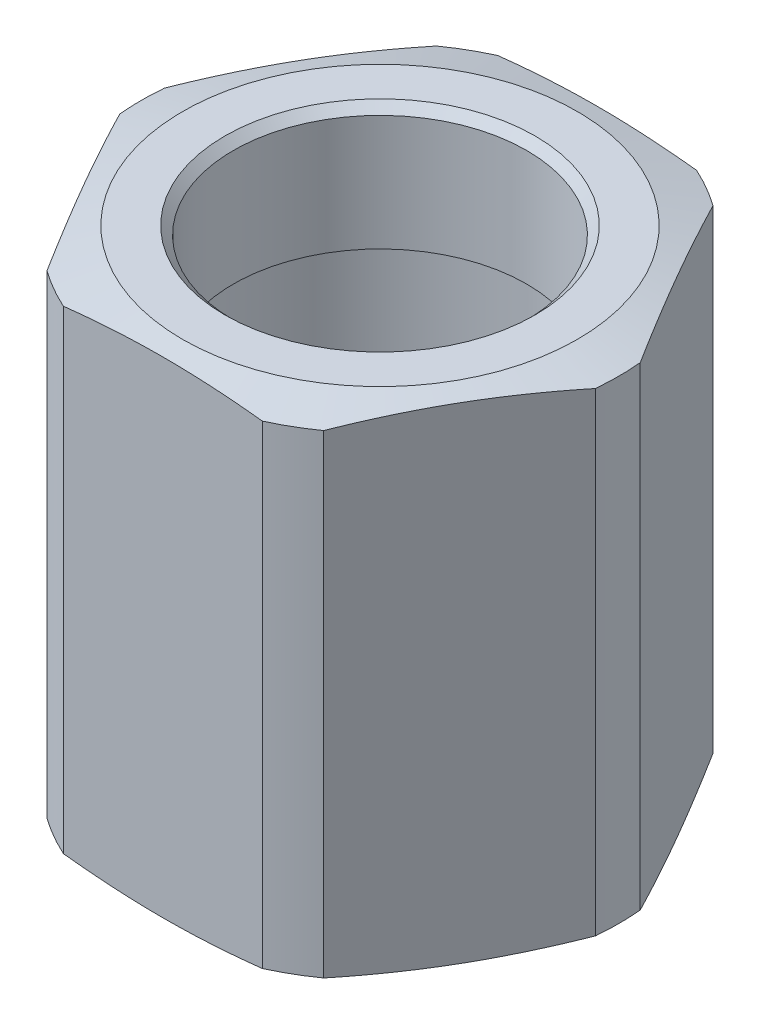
ISO-10303-21;
HEADER;
FILE_DESCRIPTION(('STEP AP214'),'2;1');
FILE_NAME('part.step','',(''),(''),'','','');
FILE_SCHEMA(('AUTOMOTIVE_DESIGN { 1 0 10303 214 1 1 1 1 }'));
ENDSEC;
DATA;
#1=APPLICATION_CONTEXT('core data for automotive mechanical design processes');
#2=APPLICATION_PROTOCOL_DEFINITION('international standard','automotive_design',2000,#1);
#3=PRODUCT_CONTEXT('',#1,'mechanical');
#4=PRODUCT('Part','Part','',(#3));
#5=PRODUCT_RELATED_PRODUCT_CATEGORY('part','',(#4));
#6=PRODUCT_DEFINITION_FORMATION('','',#4);
#7=PRODUCT_DEFINITION_CONTEXT('part definition',#1,'design');
#8=PRODUCT_DEFINITION('design','',#6,#7);
#9=PRODUCT_DEFINITION_SHAPE('','',#8);
#10=(LENGTH_UNIT() NAMED_UNIT(*) SI_UNIT(.MILLI.,.METRE.));
#11=(NAMED_UNIT(*) PLANE_ANGLE_UNIT() SI_UNIT($,.RADIAN.));
#12=(NAMED_UNIT(*) SI_UNIT($,.STERADIAN.) SOLID_ANGLE_UNIT());
#13=UNCERTAINTY_MEASURE_WITH_UNIT(LENGTH_MEASURE(1.E-05),#10,'distance_accuracy_value','');
#14=(GEOMETRIC_REPRESENTATION_CONTEXT(3) GLOBAL_UNCERTAINTY_ASSIGNED_CONTEXT((#13)) GLOBAL_UNIT_ASSIGNED_CONTEXT((#10,
#11,#12)) REPRESENTATION_CONTEXT('',''));
#15=CARTESIAN_POINT('',(0.,0.,0.));
#16=DIRECTION('',(0.,0.,1.));
#17=DIRECTION('',(1.,0.,0.));
#18=AXIS2_PLACEMENT_3D('',#15,#16,#17);
#19=CARTESIAN_POINT('',(0.,0.,0.));
#20=DIRECTION('',(0.,1.,0.));
#21=DIRECTION('',(0.,0.,1.));
#22=AXIS2_PLACEMENT_3D('',#19,#20,#21);
#23=CYLINDRICAL_SURFACE('',#22,4.7295);
#24=CARTESIAN_POINT('',(0.,12.,0.));
#25=DIRECTION('',(0.,1.,0.));
#26=DIRECTION('',(0.,0.,1.));
#27=AXIS2_PLACEMENT_3D('',#24,#25,#26);
#28=CIRCLE('',#27,4.7295);
#29=CARTESIAN_POINT('',(0.,12.,4.7295));
#30=VERTEX_POINT('',#29);
#31=EDGE_CURVE('E128',#30,#30,#28,.T.);
#32=ORIENTED_EDGE('',*,*,#31,.F.);
#33=EDGE_LOOP('',(#32));
#34=FACE_BOUND('',#33,.T.);
#35=CARTESIAN_POINT('',(0.,15.7295,0.));
#36=DIRECTION('',(0.,1.,0.));
#37=DIRECTION('',(0.,0.,1.));
#38=AXIS2_PLACEMENT_3D('',#35,#36,#37);
#39=CIRCLE('',#38,4.7295);
#40=CARTESIAN_POINT('',(0.,15.7295,4.7295));
#41=VERTEX_POINT('',#40);
#42=EDGE_CURVE('E221',#41,#41,#39,.T.);
#43=ORIENTED_EDGE('',*,*,#42,.T.);
#44=EDGE_LOOP('',(#43));
#45=FACE_BOUND('',#44,.T.);
#46=ADVANCED_FACE('F16',(#34,#45),#23,.F.);
#47=CARTESIAN_POINT('',(4.7295,12.,0.));
#48=DIRECTION('',(0.,1.,0.));
#49=DIRECTION('',(0.,0.,1.));
#50=AXIS2_PLACEMENT_3D('',#47,#48,#49);
#51=PLANE('',#50);
#52=CARTESIAN_POINT('',(0.,12.,0.));
#53=DIRECTION('',(0.,1.,0.));
#54=DIRECTION('',(0.,0.,1.));
#55=AXIS2_PLACEMENT_3D('',#52,#53,#54);
#56=CIRCLE('',#55,5.28301886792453);
#57=CARTESIAN_POINT('',(0.,12.,5.28301886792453));
#58=VERTEX_POINT('',#57);
#59=EDGE_CURVE('E133',#58,#58,#56,.T.);
#60=ORIENTED_EDGE('',*,*,#59,.F.);
#61=EDGE_LOOP('',(#60));
#62=FACE_BOUND('',#61,.T.);
#63=ORIENTED_EDGE('',*,*,#31,.T.);
#64=EDGE_LOOP('',(#63));
#65=FACE_BOUND('',#64,.T.);
#66=ADVANCED_FACE('F243',(#62,#65),#51,.F.);
#67=CARTESIAN_POINT('',(0.,0.,0.));
#68=DIRECTION('',(0.,1.,0.));
#69=DIRECTION('',(0.,0.,1.));
#70=AXIS2_PLACEMENT_3D('',#67,#68,#69);
#71=CYLINDRICAL_SURFACE('',#70,5.28301886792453);
#72=CARTESIAN_POINT('',(0.,0.25,0.));
#73=DIRECTION('',(0.,1.,0.));
#74=DIRECTION('',(0.,0.,1.));
#75=AXIS2_PLACEMENT_3D('',#72,#73,#74);
#76=CIRCLE('',#75,5.28301886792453);
#77=CARTESIAN_POINT('',(0.,0.25,5.28301886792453));
#78=VERTEX_POINT('',#77);
#79=EDGE_CURVE('E236',#78,#78,#76,.T.);
#80=ORIENTED_EDGE('',*,*,#79,.F.);
#81=EDGE_LOOP('',(#80));
#82=FACE_BOUND('',#81,.T.);
#83=ORIENTED_EDGE('',*,*,#59,.T.);
#84=EDGE_LOOP('',(#83));
#85=FACE_BOUND('',#84,.T.);
#86=ADVANCED_FACE('F241',(#82,#85),#71,.F.);
#87=CARTESIAN_POINT('',(0.,0.25,0.));
#88=DIRECTION('',(0.,-1.,0.));
#89=DIRECTION('',(0.,0.,-1.));
#90=AXIS2_PLACEMENT_3D('',#87,#88,#89);
#91=CONICAL_SURFACE('',#90,5.28301886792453,0.785398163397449);
#92=CARTESIAN_POINT('',(0.,0.,0.));
#93=DIRECTION('',(0.,1.,0.));
#94=DIRECTION('',(0.,0.,1.));
#95=AXIS2_PLACEMENT_3D('',#92,#93,#94);
#96=CIRCLE('',#95,5.53301886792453);
#97=CARTESIAN_POINT('',(0.,0.,5.53301886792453));
#98=VERTEX_POINT('',#97);
#99=EDGE_CURVE('E233',#98,#98,#96,.T.);
#100=ORIENTED_EDGE('',*,*,#99,.F.);
#101=EDGE_LOOP('',(#100));
#102=FACE_BOUND('',#101,.T.);
#103=ORIENTED_EDGE('',*,*,#79,.T.);
#104=EDGE_LOOP('',(#103));
#105=FACE_BOUND('',#104,.T.);
#106=ADVANCED_FACE('F381',(#102,#105),#91,.F.);
#107=CARTESIAN_POINT('',(5.53301886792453,0.,0.));
#108=DIRECTION('',(0.,1.,0.));
#109=DIRECTION('',(0.,0.,1.));
#110=AXIS2_PLACEMENT_3D('',#107,#108,#109);
#111=PLANE('',#110);
#112=CARTESIAN_POINT('',(0.,0.,0.));
#113=DIRECTION('',(0.,1.,0.));
#114=DIRECTION('',(0.,0.,1.));
#115=AXIS2_PLACEMENT_3D('',#112,#113,#114);
#116=CIRCLE('',#115,6.36363636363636);
#117=CARTESIAN_POINT('',(0.,0.,6.36363636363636));
#118=VERTEX_POINT('',#117);
#119=EDGE_CURVE('E230',#118,#118,#116,.T.);
#120=ORIENTED_EDGE('',*,*,#119,.F.);
#121=EDGE_LOOP('',(#120));
#122=FACE_BOUND('',#121,.T.);
#123=ORIENTED_EDGE('',*,*,#99,.T.);
#124=EDGE_LOOP('',(#123));
#125=FACE_BOUND('',#124,.T.);
#126=ADVANCED_FACE('F376',(#122,#125),#111,.F.);
#127=CARTESIAN_POINT('',(0.,0.,0.));
#128=DIRECTION('',(0.,1.,0.));
#129=DIRECTION('',(0.,0.,1.));
#130=AXIS2_PLACEMENT_3D('',#127,#128,#129);
#131=CONICAL_SURFACE('',#130,6.36363636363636,1.30899693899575);
#132=CARTESIAN_POINT('',(-10.7194153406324,1.72530776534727,7.));
#133=CARTESIAN_POINT('',(-10.40150984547,1.65400470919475,7.));
#134=CARTESIAN_POINT('',(-10.0834062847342,1.58356900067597,7.));
#135=CARTESIAN_POINT('',(-9.44670569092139,1.44490052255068,7.));
#136=CARTESIAN_POINT('',(-9.12810863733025,1.3766678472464,7.));
#137=CARTESIAN_POINT('',(-8.49004276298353,1.24281521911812,7.));
#138=CARTESIAN_POINT('',(-8.17057339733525,1.17719785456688,7.));
#139=CARTESIAN_POINT('',(-7.53097174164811,1.04927955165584,7.));
#140=CARTESIAN_POINT('',(-7.21083945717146,0.986978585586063,7.));
#141=CARTESIAN_POINT('',(-6.57236811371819,0.866967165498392,7.));
#142=CARTESIAN_POINT('',(-6.25403524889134,0.809223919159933,7.));
#143=CARTESIAN_POINT('',(-5.61650280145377,0.698747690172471,7.));
#144=CARTESIAN_POINT('',(-5.29730323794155,0.646014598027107,7.));
#145=CARTESIAN_POINT('',(-4.65797165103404,0.54673990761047,7.));
#146=CARTESIAN_POINT('',(-4.33783973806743,0.500197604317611,7.));
#147=CARTESIAN_POINT('',(-3.69655631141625,0.414670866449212,7.));
#148=CARTESIAN_POINT('',(-3.37540479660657,0.375686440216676,7.));
#149=CARTESIAN_POINT('',(-2.72844435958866,0.306372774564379,7.));
#150=CARTESIAN_POINT('',(-2.40262413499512,0.276147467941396,7.));
#151=CARTESIAN_POINT('',(-1.75015849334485,0.226433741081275,7.));
#152=CARTESIAN_POINT('',(-1.42351309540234,0.206945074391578,7.));
#153=CARTESIAN_POINT('',(-0.76987252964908,0.17984091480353,7.));
#154=CARTESIAN_POINT('',(-0.442877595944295,0.172219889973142,7.));
#155=CARTESIAN_POINT('',(0.211167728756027,0.1693201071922,7.));
#156=CARTESIAN_POINT('',(0.538218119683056,0.174041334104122,7.));
#157=CARTESIAN_POINT('',(1.19312570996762,0.195561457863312,7.));
#158=CARTESIAN_POINT('',(1.52098141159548,0.212405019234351,7.));
#159=CARTESIAN_POINT('',(2.17592552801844,0.257206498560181,7.));
#160=CARTESIAN_POINT('',(2.5030139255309,0.285164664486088,7.));
#161=CARTESIAN_POINT('',(3.15642100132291,0.350776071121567,7.00000000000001));
#162=CARTESIAN_POINT('',(3.48273902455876,0.388435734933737,7.00000000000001));
#163=CARTESIAN_POINT('',(4.13432358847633,0.471874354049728,7.));
#164=CARTESIAN_POINT('',(4.45959012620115,0.517653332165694,7.));
#165=CARTESIAN_POINT('',(5.09420517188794,0.613604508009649,7.));
#166=CARTESIAN_POINT('',(5.40359918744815,0.663478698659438,7.));
#167=CARTESIAN_POINT('',(6.0215541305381,0.768169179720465,7.00000000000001));
#168=CARTESIAN_POINT('',(6.33011503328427,0.822985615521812,7.00000000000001));
#169=CARTESIAN_POINT('',(6.94652293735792,0.936637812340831,7.00000000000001));
#170=CARTESIAN_POINT('',(7.25436986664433,0.995473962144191,7.00000000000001));
#171=CARTESIAN_POINT('',(7.86942220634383,1.11641683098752,7.00000000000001));
#172=CARTESIAN_POINT('',(8.17662760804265,1.17852359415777,7.00000000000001));
#173=CARTESIAN_POINT('',(9.0975752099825,1.36884623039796,7.00000000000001));
#174=CARTESIAN_POINT('',(9.71049531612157,1.5010354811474,7.00000000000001));
#175=CARTESIAN_POINT('',(10.9346982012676,1.7725388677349,7.00000000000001));
#176=CARTESIAN_POINT('',(11.545981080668,1.91185255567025,7.00000000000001));
#177=CARTESIAN_POINT('',(12.7611900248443,2.19403205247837,7.00000000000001));
#178=CARTESIAN_POINT('',(13.3651278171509,2.33684749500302,7.00000000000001));
#179=CARTESIAN_POINT('',(14.5721690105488,2.62600244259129,7.00000000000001));
#180=CARTESIAN_POINT('',(15.175272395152,2.77234201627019,7.00000000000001));
#181=CARTESIAN_POINT('',(16.3800638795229,3.06742409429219,7.00000000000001));
#182=CARTESIAN_POINT('',(16.9817528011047,3.21616324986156,7.00000000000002));
#183=CARTESIAN_POINT('',(18.1846138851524,3.51563120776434,7.00000000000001));
#184=CARTESIAN_POINT('',(18.7857860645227,3.66635994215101,7.00000000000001));
#185=CARTESIAN_POINT('',(19.3867794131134,3.817789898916,7.));
#186=B_SPLINE_CURVE_WITH_KNOTS('',3,(#132,#133,#134,#135,#136,#137,#138,#139,#140,#141,#142,
#143,#144,#145,#146,#147,#148,#149,#150,#151,#152,#153,#154,#155,#156,#157,#158,#159,#160,#161,
#162,#163,#164,#165,#166,#167,#168,#169,#170,#171,#172,#173,#174,#175,#176,#177,#178,#179,#180,
#181,#182,#183,#184,#185),.UNSPECIFIED.,.F.,.F.,(4,2,2,2,2,2,2,2,2,2,2,2,2,2,2,2,2,2,2,2,2,2,2,
2,2,2,4),(0.,0.977414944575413,1.95487167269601,2.93327287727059,3.91166590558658,
4.88221667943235,5.8527462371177,6.82316517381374,7.79358518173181,8.77508803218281,
9.75656835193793,10.7375910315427,11.7186125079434,12.7032671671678,13.6879437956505,
14.6732740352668,15.6586070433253,16.5987235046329,17.5388676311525,18.4791028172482,
19.4193506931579,21.3003149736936,23.1811611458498,25.0429285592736,26.9047322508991,
28.7641305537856,30.6234655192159),.UNSPECIFIED.);
#187=CARTESIAN_POINT('',(3.20780298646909,0.358077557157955,7.));
#188=VERTEX_POINT('',#187);
#189=CARTESIAN_POINT('',(-3.20780298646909,0.358077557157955,7.));
#190=VERTEX_POINT('',#189);
#191=EDGE_CURVE('E209',#188,#190,#186,.F.);
#192=ORIENTED_EDGE('',*,*,#191,.T.);
#193=CARTESIAN_POINT('',(0.,0.358077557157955,0.));
#194=DIRECTION('',(0.,1.,0.));
#195=DIRECTION('',(0.,0.,1.));
#196=AXIS2_PLACEMENT_3D('',#193,#194,#195);
#197=CIRCLE('',#196,7.7);
#198=CARTESIAN_POINT('',(-4.45827633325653,0.358077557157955,6.27803887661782));
#199=VERTEX_POINT('',#198);
#200=EDGE_CURVE('E38',#190,#199,#197,.F.);
#201=ORIENTED_EDGE('',*,*,#200,.T.);
#202=CARTESIAN_POINT('',(-4.04133641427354,0.460707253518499,7.0002));
#203=CARTESIAN_POINT('',(-4.20917732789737,0.41571547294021,6.70949101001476));
#204=CARTESIAN_POINT('',(-4.37732255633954,0.374870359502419,6.41825493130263));
#205=CARTESIAN_POINT('',(-4.71420683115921,0.303109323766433,5.83475425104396));
#206=CARTESIAN_POINT('',(-4.88294609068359,0.272197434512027,5.5424892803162));
#207=CARTESIAN_POINT('',(-5.21999536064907,0.222107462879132,4.95870282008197));
#208=CARTESIAN_POINT('',(-5.38830309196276,0.202869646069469,4.66718527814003));
#209=CARTESIAN_POINT('',(-5.72513318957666,0.177073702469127,4.08377843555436));
#210=CARTESIAN_POINT('',(-5.89365550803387,0.17051312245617,3.79188921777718));
#211=CARTESIAN_POINT('',(-6.23070014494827,0.17051312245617,3.20811078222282));
#212=CARTESIAN_POINT('',(-6.39922246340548,0.177073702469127,2.91622156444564));
#213=CARTESIAN_POINT('',(-6.73605256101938,0.202869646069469,2.33281472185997));
#214=CARTESIAN_POINT('',(-6.90436029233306,0.222107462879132,2.04129717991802));
#215=CARTESIAN_POINT('',(-7.24140956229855,0.272197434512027,1.4575107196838));
#216=CARTESIAN_POINT('',(-7.41014882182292,0.303109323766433,1.16524574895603));
#217=CARTESIAN_POINT('',(-7.7470330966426,0.374870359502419,0.581745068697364));
#218=CARTESIAN_POINT('',(-7.91517832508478,0.415715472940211,0.290508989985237));
#219=CARTESIAN_POINT('',(-8.0830192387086,0.4607072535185,-0.000200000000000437));
#220=B_SPLINE_CURVE_WITH_KNOTS('',3,(#202,#203,#204,#205,#206,#207,#208,#209,#210,#211,#212,
#213,#214,#215,#216,#217,#218,#219),.UNSPECIFIED.,.F.,.F.,(4,2,2,2,2,2,2,2,4),(0.,
1.01610389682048,2.03261982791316,3.04388955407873,4.05496356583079,5.06603757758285,
6.07730730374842,7.0938232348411,8.10992713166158),.UNSPECIFIED.);
#221=CARTESIAN_POINT('',(-7.66607931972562,0.358077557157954,0.721961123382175));
#222=VERTEX_POINT('',#221);
#223=EDGE_CURVE('E200',#199,#222,#220,.T.);
#224=ORIENTED_EDGE('',*,*,#223,.T.);
#225=CARTESIAN_POINT('',(-7.66607931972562,0.358077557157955,-0.721961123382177));
#226=VERTEX_POINT('',#225);
#227=EDGE_CURVE('E30',#222,#226,#197,.F.);
#228=ORIENTED_EDGE('',*,*,#227,.T.);
#229=CARTESIAN_POINT('',(-8.0830192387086,0.4607072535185,0.000199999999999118));
#230=CARTESIAN_POINT('',(-7.91517832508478,0.415715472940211,-0.290508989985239));
#231=CARTESIAN_POINT('',(-7.7470330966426,0.374870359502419,-0.581745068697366));
#232=CARTESIAN_POINT('',(-7.41014882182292,0.303109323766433,-1.16524574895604));
#233=CARTESIAN_POINT('',(-7.24140956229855,0.272197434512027,-1.4575107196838));
#234=CARTESIAN_POINT('',(-6.90436029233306,0.222107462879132,-2.04129717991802));
#235=CARTESIAN_POINT('',(-6.73605256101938,0.20286964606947,-2.33281472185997));
#236=CARTESIAN_POINT('',(-6.39922246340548,0.177073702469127,-2.91622156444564));
#237=CARTESIAN_POINT('',(-6.23070014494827,0.17051312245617,-3.20811078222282));
#238=CARTESIAN_POINT('',(-5.89365550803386,0.17051312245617,-3.79188921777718));
#239=CARTESIAN_POINT('',(-5.72513318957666,0.177073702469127,-4.08377843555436));
#240=CARTESIAN_POINT('',(-5.38830309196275,0.20286964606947,-4.66718527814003));
#241=CARTESIAN_POINT('',(-5.21999536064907,0.222107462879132,-4.95870282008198));
#242=CARTESIAN_POINT('',(-4.88294609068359,0.272197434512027,-5.5424892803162));
#243=CARTESIAN_POINT('',(-4.71420683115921,0.303109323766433,-5.83475425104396));
#244=CARTESIAN_POINT('',(-4.37732255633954,0.37487035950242,-6.41825493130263));
#245=CARTESIAN_POINT('',(-4.20917732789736,0.415715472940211,-6.70949101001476));
#246=CARTESIAN_POINT('',(-4.04133641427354,0.4607072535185,-7.0002));
#247=B_SPLINE_CURVE_WITH_KNOTS('',3,(#229,#230,#231,#232,#233,#234,#235,#236,#237,#238,#239,
#240,#241,#242,#243,#244,#245,#246),.UNSPECIFIED.,.F.,.F.,(4,2,2,2,2,2,2,2,4),(0.,
1.01610389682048,2.03261982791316,3.04388955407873,4.05496356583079,5.06603757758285,
6.07730730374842,7.0938232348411,8.10992713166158),.UNSPECIFIED.);
#248=CARTESIAN_POINT('',(-4.45827633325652,0.358077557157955,-6.27803887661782));
#249=VERTEX_POINT('',#248);
#250=EDGE_CURVE('E208',#226,#249,#247,.T.);
#251=ORIENTED_EDGE('',*,*,#250,.T.);
#252=CARTESIAN_POINT('',(-3.20780298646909,0.358077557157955,-7.));
#253=VERTEX_POINT('',#252);
#254=EDGE_CURVE('E579',#249,#253,#197,.F.);
#255=ORIENTED_EDGE('',*,*,#254,.T.);
#256=CARTESIAN_POINT('',(-10.7194153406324,1.72530776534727,-7.));
#257=CARTESIAN_POINT('',(-10.40150984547,1.65400470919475,-7.));
#258=CARTESIAN_POINT('',(-10.0834062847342,1.58356900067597,-7.));
#259=CARTESIAN_POINT('',(-9.44670569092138,1.44490052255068,-7.));
#260=CARTESIAN_POINT('',(-9.12810863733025,1.3766678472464,-7.));
#261=CARTESIAN_POINT('',(-8.49004276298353,1.24281521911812,-7.));
#262=CARTESIAN_POINT('',(-8.17057339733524,1.17719785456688,-7.));
#263=CARTESIAN_POINT('',(-7.53097174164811,1.04927955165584,-7.));
#264=CARTESIAN_POINT('',(-7.21083945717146,0.986978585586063,-7.));
#265=CARTESIAN_POINT('',(-6.57236811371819,0.866967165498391,-7.));
#266=CARTESIAN_POINT('',(-6.25403524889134,0.809223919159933,-7.));
#267=CARTESIAN_POINT('',(-5.61650280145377,0.698747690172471,-7.));
#268=CARTESIAN_POINT('',(-5.29730323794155,0.646014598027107,-7.));
#269=CARTESIAN_POINT('',(-4.65797165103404,0.54673990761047,-7.));
#270=CARTESIAN_POINT('',(-4.33783973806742,0.500197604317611,-7.));
#271=CARTESIAN_POINT('',(-3.69655631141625,0.414670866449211,-7.));
#272=CARTESIAN_POINT('',(-3.37540479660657,0.375686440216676,-7.));
#273=CARTESIAN_POINT('',(-2.72844435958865,0.306372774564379,-7.));
#274=CARTESIAN_POINT('',(-2.40262413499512,0.276147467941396,-7.));
#275=CARTESIAN_POINT('',(-1.75015849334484,0.226433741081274,-7.));
#276=CARTESIAN_POINT('',(-1.42351309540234,0.206945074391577,-7.));
#277=CARTESIAN_POINT('',(-0.769872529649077,0.179840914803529,-7.));
#278=CARTESIAN_POINT('',(-0.442877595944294,0.172219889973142,-7.));
#279=CARTESIAN_POINT('',(0.211167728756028,0.169320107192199,-7.));
#280=CARTESIAN_POINT('',(0.538218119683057,0.174041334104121,-7.));
#281=CARTESIAN_POINT('',(1.19312570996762,0.195561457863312,-7.));
#282=CARTESIAN_POINT('',(1.52098141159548,0.21240501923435,-7.));
#283=CARTESIAN_POINT('',(2.17592552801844,0.25720649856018,-7.));
#284=CARTESIAN_POINT('',(2.5030139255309,0.285164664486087,-7.));
#285=CARTESIAN_POINT('',(3.15642100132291,0.350776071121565,-7.));
#286=CARTESIAN_POINT('',(3.48273902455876,0.388435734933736,-7.));
#287=CARTESIAN_POINT('',(4.13432358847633,0.471874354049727,-7.));
#288=CARTESIAN_POINT('',(4.45959012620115,0.517653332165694,-7.));
#289=CARTESIAN_POINT('',(5.09420517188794,0.613604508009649,-7.));
#290=CARTESIAN_POINT('',(5.40359918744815,0.663478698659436,-7.));
#291=CARTESIAN_POINT('',(6.0215541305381,0.768169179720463,-7.));
#292=CARTESIAN_POINT('',(6.33011503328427,0.822985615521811,-7.));
#293=CARTESIAN_POINT('',(6.94652293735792,0.936637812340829,-7.));
#294=CARTESIAN_POINT('',(7.25436986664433,0.99547396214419,-7.));
#295=CARTESIAN_POINT('',(7.86942220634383,1.11641683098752,-7.));
#296=CARTESIAN_POINT('',(8.17662760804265,1.17852359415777,-7.));
#297=CARTESIAN_POINT('',(9.0975752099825,1.36884623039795,-7.));
#298=CARTESIAN_POINT('',(9.71049531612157,1.5010354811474,-7.));
#299=CARTESIAN_POINT('',(10.9346982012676,1.77253886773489,-7.));
#300=CARTESIAN_POINT('',(11.545981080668,1.91185255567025,-7.));
#301=CARTESIAN_POINT('',(12.7611900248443,2.19403205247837,-7.));
#302=CARTESIAN_POINT('',(13.3651278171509,2.33684749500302,-7.));
#303=CARTESIAN_POINT('',(14.5721690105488,2.62600244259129,-7.));
#304=CARTESIAN_POINT('',(15.175272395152,2.77234201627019,-7.));
#305=CARTESIAN_POINT('',(16.3800638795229,3.06742409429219,-7.));
#306=CARTESIAN_POINT('',(16.9817528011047,3.21616324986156,-7.));
#307=CARTESIAN_POINT('',(18.1846138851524,3.51563120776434,-7.));
#308=CARTESIAN_POINT('',(18.7857860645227,3.66635994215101,-7.));
#309=CARTESIAN_POINT('',(19.3867794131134,3.817789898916,-7.));
#310=B_SPLINE_CURVE_WITH_KNOTS('',3,(#256,#257,#258,#259,#260,#261,#262,#263,#264,#265,#266,
#267,#268,#269,#270,#271,#272,#273,#274,#275,#276,#277,#278,#279,#280,#281,#282,#283,#284,#285,
#286,#287,#288,#289,#290,#291,#292,#293,#294,#295,#296,#297,#298,#299,#300,#301,#302,#303,#304,
#305,#306,#307,#308,#309),.UNSPECIFIED.,.F.,.F.,(4,2,2,2,2,2,2,2,2,2,2,2,2,2,2,2,2,2,2,2,2,2,2,
2,2,2,4),(0.,0.977414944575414,1.95487167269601,2.93327287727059,3.91166590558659,
4.88221667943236,5.85274623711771,6.82316517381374,7.79358518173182,8.77508803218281,
9.75656835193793,10.7375910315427,11.7186125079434,12.7032671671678,13.6879437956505,
14.6732740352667,15.6586070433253,16.5987235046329,17.5388676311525,18.4791028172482,
19.4193506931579,21.3003149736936,23.1811611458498,25.0429285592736,26.9047322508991,
28.7641305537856,30.6234655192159),.UNSPECIFIED.);
#311=CARTESIAN_POINT('',(3.20780298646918,0.35807755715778,-7.));
#312=VERTEX_POINT('',#311);
#313=EDGE_CURVE('E531',#253,#312,#310,.T.);
#314=ORIENTED_EDGE('',*,*,#313,.T.);
#315=CARTESIAN_POINT('',(4.45827633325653,0.358077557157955,-6.27803887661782));
#316=VERTEX_POINT('',#315);
#317=EDGE_CURVE('E108',#312,#316,#197,.F.);
#318=ORIENTED_EDGE('',*,*,#317,.T.);
#319=CARTESIAN_POINT('',(4.04133641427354,0.4607072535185,-7.0002));
#320=CARTESIAN_POINT('',(4.20917732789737,0.415715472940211,-6.70949101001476));
#321=CARTESIAN_POINT('',(4.37732255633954,0.37487035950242,-6.41825493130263));
#322=CARTESIAN_POINT('',(4.71420683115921,0.303109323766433,-5.83475425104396));
#323=CARTESIAN_POINT('',(4.88294609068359,0.272197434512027,-5.5424892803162));
#324=CARTESIAN_POINT('',(5.21999536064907,0.222107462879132,-4.95870282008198));
#325=CARTESIAN_POINT('',(5.38830309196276,0.20286964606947,-4.66718527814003));
#326=CARTESIAN_POINT('',(5.72513318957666,0.177073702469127,-4.08377843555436));
#327=CARTESIAN_POINT('',(5.89365550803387,0.17051312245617,-3.79188921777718));
#328=CARTESIAN_POINT('',(6.23070014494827,0.17051312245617,-3.20811078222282));
#329=CARTESIAN_POINT('',(6.39922246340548,0.177073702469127,-2.91622156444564));
#330=CARTESIAN_POINT('',(6.73605256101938,0.20286964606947,-2.33281472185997));
#331=CARTESIAN_POINT('',(6.90436029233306,0.222107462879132,-2.04129717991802));
#332=CARTESIAN_POINT('',(7.24140956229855,0.272197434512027,-1.4575107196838));
#333=CARTESIAN_POINT('',(7.41014882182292,0.303109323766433,-1.16524574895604));
#334=CARTESIAN_POINT('',(7.7470330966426,0.374870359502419,-0.581745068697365));
#335=CARTESIAN_POINT('',(7.91517832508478,0.415715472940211,-0.290508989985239));
#336=CARTESIAN_POINT('',(8.0830192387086,0.4607072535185,0.000199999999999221));
#337=B_SPLINE_CURVE_WITH_KNOTS('',3,(#319,#320,#321,#322,#323,#324,#325,#326,#327,#328,#329,
#330,#331,#332,#333,#334,#335,#336),.UNSPECIFIED.,.F.,.F.,(4,2,2,2,2,2,2,2,4),(0.,
1.01610389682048,2.03261982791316,3.04388955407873,4.05496356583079,5.06603757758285,
6.07730730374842,7.0938232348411,8.10992713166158),.UNSPECIFIED.);
#338=CARTESIAN_POINT('',(7.66607931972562,0.358077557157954,-0.721961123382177));
#339=VERTEX_POINT('',#338);
#340=EDGE_CURVE('E527',#316,#339,#337,.T.);
#341=ORIENTED_EDGE('',*,*,#340,.T.);
#342=CARTESIAN_POINT('',(7.66607931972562,0.358077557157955,0.721961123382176));
#343=VERTEX_POINT('',#342);
#344=EDGE_CURVE('E571',#339,#343,#197,.F.);
#345=ORIENTED_EDGE('',*,*,#344,.T.);
#346=CARTESIAN_POINT('',(8.0830192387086,0.4607072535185,-0.000200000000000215));
#347=CARTESIAN_POINT('',(7.91517832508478,0.415715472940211,0.290508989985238));
#348=CARTESIAN_POINT('',(7.7470330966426,0.374870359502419,0.581745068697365));
#349=CARTESIAN_POINT('',(7.41014882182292,0.303109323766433,1.16524574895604));
#350=CARTESIAN_POINT('',(7.24140956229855,0.272197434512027,1.4575107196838));
#351=CARTESIAN_POINT('',(6.90436029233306,0.222107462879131,2.04129717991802));
#352=CARTESIAN_POINT('',(6.73605256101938,0.202869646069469,2.33281472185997));
#353=CARTESIAN_POINT('',(6.39922246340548,0.177073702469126,2.91622156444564));
#354=CARTESIAN_POINT('',(6.23070014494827,0.170513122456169,3.20811078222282));
#355=CARTESIAN_POINT('',(5.89365550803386,0.170513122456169,3.79188921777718));
#356=CARTESIAN_POINT('',(5.72513318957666,0.177073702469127,4.08377843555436));
#357=CARTESIAN_POINT('',(5.38830309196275,0.202869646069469,4.66718527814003));
#358=CARTESIAN_POINT('',(5.21999536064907,0.222107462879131,4.95870282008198));
#359=CARTESIAN_POINT('',(4.88294609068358,0.272197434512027,5.5424892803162));
#360=CARTESIAN_POINT('',(4.71420683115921,0.303109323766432,5.83475425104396));
#361=CARTESIAN_POINT('',(4.37732255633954,0.374870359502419,6.41825493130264));
#362=CARTESIAN_POINT('',(4.20917732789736,0.41571547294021,6.70949101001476));
#363=CARTESIAN_POINT('',(4.04133641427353,0.460707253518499,7.0002));
#364=B_SPLINE_CURVE_WITH_KNOTS('',3,(#346,#347,#348,#349,#350,#351,#352,#353,#354,#355,#356,
#357,#358,#359,#360,#361,#362,#363),.UNSPECIFIED.,.F.,.F.,(4,2,2,2,2,2,2,2,4),(0.,
1.01610389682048,2.03261982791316,3.04388955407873,4.05496356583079,5.06603757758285,
6.07730730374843,7.09382323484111,8.10992713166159),.UNSPECIFIED.);
#365=CARTESIAN_POINT('',(4.45827633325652,0.358077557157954,6.27803887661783));
#366=VERTEX_POINT('',#365);
#367=EDGE_CURVE('E526',#343,#366,#364,.T.);
#368=ORIENTED_EDGE('',*,*,#367,.T.);
#369=EDGE_CURVE('E524',#366,#188,#197,.F.);
#370=ORIENTED_EDGE('',*,*,#369,.T.);
#371=EDGE_LOOP('',(#192,#201,#224,#228,#251,#255,#314,#318,#341,#345,#368,#370));
#372=FACE_BOUND('',#371,.T.);
#373=ORIENTED_EDGE('',*,*,#119,.T.);
#374=EDGE_LOOP('',(#373));
#375=FACE_BOUND('',#374,.T.);
#376=ADVANCED_FACE('F155',(#372,#375),#131,.T.);
#377=CARTESIAN_POINT('',(0.,14.8916647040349,0.));
#378=DIRECTION('',(0.,-1.,0.));
#379=DIRECTION('',(0.,0.,-1.));
#380=AXIS2_PLACEMENT_3D('',#377,#378,#379);
#381=CONICAL_SURFACE('',#380,10.5,1.30899693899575);
#382=CARTESIAN_POINT('',(-10.7194153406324,14.2746922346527,-7.));
#383=CARTESIAN_POINT('',(-10.40150984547,14.3459952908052,-7.));
#384=CARTESIAN_POINT('',(-10.0834062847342,14.416430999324,-7.));
#385=CARTESIAN_POINT('',(-9.44670569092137,14.5550994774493,-7.));
#386=CARTESIAN_POINT('',(-9.12810863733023,14.6233321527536,-7.));
#387=CARTESIAN_POINT('',(-8.49004276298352,14.7571847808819,-7.));
#388=CARTESIAN_POINT('',(-8.17057339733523,14.8228021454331,-7.));
#389=CARTESIAN_POINT('',(-7.5309717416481,14.9507204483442,-7.));
#390=CARTESIAN_POINT('',(-7.21083945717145,15.0130214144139,-7.));
#391=CARTESIAN_POINT('',(-6.57236811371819,15.1330328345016,-7.));
#392=CARTESIAN_POINT('',(-6.25403524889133,15.1907760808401,-7.));
#393=CARTESIAN_POINT('',(-5.61650280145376,15.3012523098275,-7.));
#394=CARTESIAN_POINT('',(-5.29730323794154,15.3539854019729,-7.));
#395=CARTESIAN_POINT('',(-4.65797165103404,15.4532600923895,-7.));
#396=CARTESIAN_POINT('',(-4.33783973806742,15.4998023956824,-7.));
#397=CARTESIAN_POINT('',(-3.69655631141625,15.5853291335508,-7.));
#398=CARTESIAN_POINT('',(-3.37540479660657,15.6243135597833,-7.));
#399=CARTESIAN_POINT('',(-2.72844435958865,15.6936272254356,-7.));
#400=CARTESIAN_POINT('',(-2.40262413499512,15.7238525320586,-7.));
#401=CARTESIAN_POINT('',(-1.75015849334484,15.7735662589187,-7.));
#402=CARTESIAN_POINT('',(-1.42351309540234,15.7930549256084,-7.));
#403=CARTESIAN_POINT('',(-0.769872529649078,15.8201590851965,-7.));
#404=CARTESIAN_POINT('',(-0.442877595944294,15.8277801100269,-7.));
#405=CARTESIAN_POINT('',(0.211167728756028,15.8306798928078,-7.));
#406=CARTESIAN_POINT('',(0.538218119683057,15.8259586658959,-7.));
#407=CARTESIAN_POINT('',(1.19312570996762,15.8044385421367,-7.));
#408=CARTESIAN_POINT('',(1.52098141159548,15.7875949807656,-7.));
#409=CARTESIAN_POINT('',(2.17592552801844,15.7427935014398,-7.));
#410=CARTESIAN_POINT('',(2.5030139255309,15.7148353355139,-7.));
#411=CARTESIAN_POINT('',(3.1564210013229,15.6492239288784,-7.));
#412=CARTESIAN_POINT('',(3.48273902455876,15.6115642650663,-7.));
#413=CARTESIAN_POINT('',(4.13432358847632,15.5281256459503,-7.));
#414=CARTESIAN_POINT('',(4.45959012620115,15.4823466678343,-7.));
#415=CARTESIAN_POINT('',(5.09420517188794,15.3863954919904,-7.));
#416=CARTESIAN_POINT('',(5.40359918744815,15.3365213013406,-7.));
#417=CARTESIAN_POINT('',(6.02155413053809,15.2318308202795,-7.));
#418=CARTESIAN_POINT('',(6.33011503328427,15.1770143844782,-7.));
#419=CARTESIAN_POINT('',(6.94652293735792,15.0633621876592,-7.));
#420=CARTESIAN_POINT('',(7.25436986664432,15.0045260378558,-7.));
#421=CARTESIAN_POINT('',(7.86942220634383,14.8835831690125,-7.));
#422=CARTESIAN_POINT('',(8.17662760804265,14.8214764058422,-7.));
#423=CARTESIAN_POINT('',(9.0975752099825,14.631153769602,-7.));
#424=CARTESIAN_POINT('',(9.71049531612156,14.4989645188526,-7.));
#425=CARTESIAN_POINT('',(10.9346982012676,14.2274611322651,-7.));
#426=CARTESIAN_POINT('',(11.545981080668,14.0881474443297,-7.));
#427=CARTESIAN_POINT('',(12.7611900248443,13.8059679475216,-7.));
#428=CARTESIAN_POINT('',(13.3651278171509,13.663152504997,-7.));
#429=CARTESIAN_POINT('',(14.5721690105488,13.3739975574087,-7.));
#430=CARTESIAN_POINT('',(15.1752723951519,13.2276579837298,-7.));
#431=CARTESIAN_POINT('',(16.3800638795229,12.9325759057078,-7.));
#432=CARTESIAN_POINT('',(16.9817528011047,12.7838367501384,-7.));
#433=CARTESIAN_POINT('',(18.1846138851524,12.4843687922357,-7.));
#434=CARTESIAN_POINT('',(18.7857860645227,12.333640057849,-7.));
#435=CARTESIAN_POINT('',(19.3867794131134,12.182210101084,-7.));
#436=B_SPLINE_CURVE_WITH_KNOTS('',3,(#382,#383,#384,#385,#386,#387,#388,#389,#390,#391,#392,
#393,#394,#395,#396,#397,#398,#399,#400,#401,#402,#403,#404,#405,#406,#407,#408,#409,#410,#411,
#412,#413,#414,#415,#416,#417,#418,#419,#420,#421,#422,#423,#424,#425,#426,#427,#428,#429,#430,
#431,#432,#433,#434,#435),.UNSPECIFIED.,.F.,.F.,(4,2,2,2,2,2,2,2,2,2,2,2,2,2,2,2,2,2,2,2,2,2,2,
2,2,2,4),(0.,0.977414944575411,1.95487167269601,2.93327287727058,3.91166590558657,
4.88221667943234,5.85274623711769,6.82316517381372,7.7935851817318,8.77508803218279,
9.75656835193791,10.7375910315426,11.7186125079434,12.7032671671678,13.6879437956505,
14.6732740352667,15.6586070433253,16.5987235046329,17.5388676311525,18.4791028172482,
19.4193506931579,21.3003149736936,23.1811611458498,25.0429285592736,26.904732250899,
28.7641305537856,30.6234655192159),.UNSPECIFIED.);
#437=CARTESIAN_POINT('',(3.20780298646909,15.6419224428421,-7.));
#438=VERTEX_POINT('',#437);
#439=CARTESIAN_POINT('',(-3.20780298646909,15.6419224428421,-7.));
#440=VERTEX_POINT('',#439);
#441=EDGE_CURVE('E120',#438,#440,#436,.F.);
#442=ORIENTED_EDGE('',*,*,#441,.T.);
#443=CARTESIAN_POINT('',(0.,15.6419224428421,0.));
#444=DIRECTION('',(0.,-1.,0.));
#445=DIRECTION('',(0.,0.,-1.));
#446=AXIS2_PLACEMENT_3D('',#443,#444,#445);
#447=CIRCLE('',#446,7.7);
#448=CARTESIAN_POINT('',(-4.45827633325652,15.6419224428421,-6.27803887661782));
#449=VERTEX_POINT('',#448);
#450=EDGE_CURVE('E126',#440,#449,#447,.F.);
#451=ORIENTED_EDGE('',*,*,#450,.T.);
#452=CARTESIAN_POINT('',(-4.04133641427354,15.5392927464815,-7.0002));
#453=CARTESIAN_POINT('',(-4.20917732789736,15.5842845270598,-6.70949101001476));
#454=CARTESIAN_POINT('',(-4.37732255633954,15.6251296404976,-6.41825493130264));
#455=CARTESIAN_POINT('',(-4.71420683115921,15.6968906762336,-5.83475425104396));
#456=CARTESIAN_POINT('',(-4.88294609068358,15.727802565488,-5.5424892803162));
#457=CARTESIAN_POINT('',(-5.21999536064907,15.7778925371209,-4.95870282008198));
#458=CARTESIAN_POINT('',(-5.38830309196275,15.7971303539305,-4.66718527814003));
#459=CARTESIAN_POINT('',(-5.72513318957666,15.8229262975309,-4.08377843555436));
#460=CARTESIAN_POINT('',(-5.89365550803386,15.8294868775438,-3.79188921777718));
#461=CARTESIAN_POINT('',(-6.23070014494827,15.8294868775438,-3.20811078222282));
#462=CARTESIAN_POINT('',(-6.39922246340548,15.8229262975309,-2.91622156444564));
#463=CARTESIAN_POINT('',(-6.73605256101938,15.7971303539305,-2.33281472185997));
#464=CARTESIAN_POINT('',(-6.90436029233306,15.7778925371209,-2.04129717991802));
#465=CARTESIAN_POINT('',(-7.24140956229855,15.727802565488,-1.4575107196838));
#466=CARTESIAN_POINT('',(-7.41014882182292,15.6968906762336,-1.16524574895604));
#467=CARTESIAN_POINT('',(-7.7470330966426,15.6251296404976,-0.581745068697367));
#468=CARTESIAN_POINT('',(-7.91517832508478,15.5842845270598,-0.29050898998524));
#469=CARTESIAN_POINT('',(-8.0830192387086,15.5392927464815,0.000199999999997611));
#470=B_SPLINE_CURVE_WITH_KNOTS('',3,(#452,#453,#454,#455,#456,#457,#458,#459,#460,#461,#462,
#463,#464,#465,#466,#467,#468,#469),.UNSPECIFIED.,.F.,.F.,(4,2,2,2,2,2,2,2,4),(0.,
1.01610389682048,2.03261982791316,3.04388955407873,4.05496356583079,5.06603757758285,
6.07730730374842,7.0938232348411,8.10992713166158),.UNSPECIFIED.);
#471=CARTESIAN_POINT('',(-7.66607931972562,15.6419224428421,-0.721961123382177));
#472=VERTEX_POINT('',#471);
#473=EDGE_CURVE('E113',#449,#472,#470,.T.);
#474=ORIENTED_EDGE('',*,*,#473,.T.);
#475=CARTESIAN_POINT('',(-7.66607931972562,15.6419224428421,0.721961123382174));
#476=VERTEX_POINT('',#475);
#477=EDGE_CURVE('E125',#472,#476,#447,.F.);
#478=ORIENTED_EDGE('',*,*,#477,.T.);
#479=CARTESIAN_POINT('',(-8.0830192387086,15.5392927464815,-0.000200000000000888));
#480=CARTESIAN_POINT('',(-7.91517832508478,15.5842845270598,0.290508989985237));
#481=CARTESIAN_POINT('',(-7.7470330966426,15.6251296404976,0.581745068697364));
#482=CARTESIAN_POINT('',(-7.41014882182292,15.6968906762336,1.16524574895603));
#483=CARTESIAN_POINT('',(-7.24140956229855,15.727802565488,1.4575107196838));
#484=CARTESIAN_POINT('',(-6.90436029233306,15.7778925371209,2.04129717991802));
#485=CARTESIAN_POINT('',(-6.73605256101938,15.7971303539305,2.33281472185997));
#486=CARTESIAN_POINT('',(-6.39922246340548,15.8229262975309,2.91622156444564));
#487=CARTESIAN_POINT('',(-6.23070014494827,15.8294868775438,3.20811078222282));
#488=CARTESIAN_POINT('',(-5.89365550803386,15.8294868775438,3.79188921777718));
#489=CARTESIAN_POINT('',(-5.72513318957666,15.8229262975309,4.08377843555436));
#490=CARTESIAN_POINT('',(-5.38830309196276,15.7971303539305,4.66718527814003));
#491=CARTESIAN_POINT('',(-5.21999536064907,15.7778925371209,4.95870282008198));
#492=CARTESIAN_POINT('',(-4.88294609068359,15.727802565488,5.5424892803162));
#493=CARTESIAN_POINT('',(-4.71420683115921,15.6968906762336,5.83475425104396));
#494=CARTESIAN_POINT('',(-4.37732255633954,15.6251296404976,6.41825493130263));
#495=CARTESIAN_POINT('',(-4.20917732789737,15.5842845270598,6.70949101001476));
#496=CARTESIAN_POINT('',(-4.04133641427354,15.5392927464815,7.0002));
#497=B_SPLINE_CURVE_WITH_KNOTS('',3,(#479,#480,#481,#482,#483,#484,#485,#486,#487,#488,#489,
#490,#491,#492,#493,#494,#495,#496),.UNSPECIFIED.,.F.,.F.,(4,2,2,2,2,2,2,2,4),(0.,
1.01610389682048,2.03261982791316,3.04388955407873,4.05496356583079,5.06603757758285,
6.07730730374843,7.09382323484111,8.10992713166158),.UNSPECIFIED.);
#498=CARTESIAN_POINT('',(-4.45827633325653,15.6419224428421,6.27803887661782));
#499=VERTEX_POINT('',#498);
#500=EDGE_CURVE('E178',#476,#499,#497,.T.);
#501=ORIENTED_EDGE('',*,*,#500,.T.);
#502=CARTESIAN_POINT('',(-3.20780298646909,15.6419224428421,7.));
#503=VERTEX_POINT('',#502);
#504=EDGE_CURVE('E561',#499,#503,#447,.F.);
#505=ORIENTED_EDGE('',*,*,#504,.T.);
#506=CARTESIAN_POINT('',(-10.7194153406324,14.2746922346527,7.));
#507=CARTESIAN_POINT('',(-10.40150984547,14.3459952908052,7.));
#508=CARTESIAN_POINT('',(-10.0834062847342,14.416430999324,7.));
#509=CARTESIAN_POINT('',(-9.44670569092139,14.5550994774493,7.));
#510=CARTESIAN_POINT('',(-9.12810863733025,14.6233321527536,7.));
#511=CARTESIAN_POINT('',(-8.49004276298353,14.7571847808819,7.));
#512=CARTESIAN_POINT('',(-8.17057339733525,14.8228021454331,7.));
#513=CARTESIAN_POINT('',(-7.53097174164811,14.9507204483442,7.));
#514=CARTESIAN_POINT('',(-7.21083945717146,15.0130214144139,7.));
#515=CARTESIAN_POINT('',(-6.5723681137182,15.1330328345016,7.));
#516=CARTESIAN_POINT('',(-6.25403524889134,15.1907760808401,7.));
#517=CARTESIAN_POINT('',(-5.61650280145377,15.3012523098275,7.));
#518=CARTESIAN_POINT('',(-5.29730323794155,15.3539854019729,7.));
#519=CARTESIAN_POINT('',(-4.65797165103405,15.4532600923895,7.));
#520=CARTESIAN_POINT('',(-4.33783973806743,15.4998023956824,7.));
#521=CARTESIAN_POINT('',(-3.69655631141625,15.5853291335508,7.));
#522=CARTESIAN_POINT('',(-3.37540479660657,15.6243135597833,7.));
#523=CARTESIAN_POINT('',(-2.72844435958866,15.6936272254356,7.));
#524=CARTESIAN_POINT('',(-2.40262413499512,15.7238525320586,7.));
#525=CARTESIAN_POINT('',(-1.75015849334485,15.7735662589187,7.));
#526=CARTESIAN_POINT('',(-1.42351309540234,15.7930549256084,7.));
#527=CARTESIAN_POINT('',(-0.769872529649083,15.8201590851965,7.));
#528=CARTESIAN_POINT('',(-0.4428775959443,15.8277801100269,7.));
#529=CARTESIAN_POINT('',(0.211167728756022,15.8306798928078,7.));
#530=CARTESIAN_POINT('',(0.538218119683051,15.8259586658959,7.));
#531=CARTESIAN_POINT('',(1.19312570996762,15.8044385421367,7.));
#532=CARTESIAN_POINT('',(1.52098141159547,15.7875949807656,7.));
#533=CARTESIAN_POINT('',(2.17592552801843,15.7427935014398,7.));
#534=CARTESIAN_POINT('',(2.50301392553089,15.7148353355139,7.));
#535=CARTESIAN_POINT('',(3.1564210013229,15.6492239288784,7.00000000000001));
#536=CARTESIAN_POINT('',(3.48273902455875,15.6115642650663,7.00000000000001));
#537=CARTESIAN_POINT('',(4.13432358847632,15.5281256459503,7.));
#538=CARTESIAN_POINT('',(4.45959012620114,15.4823466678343,7.));
#539=CARTESIAN_POINT('',(5.09420517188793,15.3863954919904,7.));
#540=CARTESIAN_POINT('',(5.40359918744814,15.3365213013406,7.));
#541=CARTESIAN_POINT('',(6.02155413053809,15.2318308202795,7.00000000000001));
#542=CARTESIAN_POINT('',(6.33011503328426,15.1770143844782,7.00000000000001));
#543=CARTESIAN_POINT('',(6.94652293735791,15.0633621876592,7.00000000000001));
#544=CARTESIAN_POINT('',(7.25436986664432,15.0045260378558,7.00000000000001));
#545=CARTESIAN_POINT('',(7.86942220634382,14.8835831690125,7.00000000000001));
#546=CARTESIAN_POINT('',(8.17662760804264,14.8214764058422,7.00000000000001));
#547=CARTESIAN_POINT('',(9.09757520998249,14.631153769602,7.00000000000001));
#548=CARTESIAN_POINT('',(9.71049531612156,14.4989645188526,7.00000000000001));
#549=CARTESIAN_POINT('',(10.9346982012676,14.2274611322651,7.00000000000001));
#550=CARTESIAN_POINT('',(11.545981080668,14.0881474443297,7.00000000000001));
#551=CARTESIAN_POINT('',(12.7611900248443,13.8059679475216,7.00000000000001));
#552=CARTESIAN_POINT('',(13.3651278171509,13.663152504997,7.00000000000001));
#553=CARTESIAN_POINT('',(14.5721690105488,13.3739975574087,7.00000000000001));
#554=CARTESIAN_POINT('',(15.1752723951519,13.2276579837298,7.00000000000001));
#555=CARTESIAN_POINT('',(16.3800638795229,12.9325759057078,7.00000000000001));
#556=CARTESIAN_POINT('',(16.9817528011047,12.7838367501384,7.00000000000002));
#557=CARTESIAN_POINT('',(18.1846138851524,12.4843687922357,7.00000000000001));
#558=CARTESIAN_POINT('',(18.7857860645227,12.333640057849,7.00000000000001));
#559=CARTESIAN_POINT('',(19.3867794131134,12.182210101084,7.));
#560=B_SPLINE_CURVE_WITH_KNOTS('',3,(#506,#507,#508,#509,#510,#511,#512,#513,#514,#515,#516,
#517,#518,#519,#520,#521,#522,#523,#524,#525,#526,#527,#528,#529,#530,#531,#532,#533,#534,#535,
#536,#537,#538,#539,#540,#541,#542,#543,#544,#545,#546,#547,#548,#549,#550,#551,#552,#553,#554,
#555,#556,#557,#558,#559),.UNSPECIFIED.,.F.,.F.,(4,2,2,2,2,2,2,2,2,2,2,2,2,2,2,2,2,2,2,2,2,2,2,
2,2,2,4),(0.,0.977414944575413,1.95487167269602,2.93327287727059,3.91166590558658,
4.88221667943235,5.8527462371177,6.82316517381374,7.79358518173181,8.77508803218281,
9.75656835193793,10.7375910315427,11.7186125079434,12.7032671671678,13.6879437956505,
14.6732740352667,15.6586070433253,16.5987235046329,17.5388676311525,18.4791028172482,
19.4193506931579,21.3003149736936,23.1811611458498,25.0429285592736,26.9047322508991,
28.7641305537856,30.6234655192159),.UNSPECIFIED.);
#561=CARTESIAN_POINT('',(3.20780298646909,15.6419224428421,7.));
#562=VERTEX_POINT('',#561);
#563=EDGE_CURVE('E171',#503,#562,#560,.T.);
#564=ORIENTED_EDGE('',*,*,#563,.T.);
#565=CARTESIAN_POINT('',(4.45827633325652,15.6419224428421,6.27803887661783));
#566=VERTEX_POINT('',#565);
#567=EDGE_CURVE('E567',#562,#566,#447,.F.);
#568=ORIENTED_EDGE('',*,*,#567,.T.);
#569=CARTESIAN_POINT('',(4.04133641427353,15.5392927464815,7.0002));
#570=CARTESIAN_POINT('',(4.20917732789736,15.5842845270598,6.70949101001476));
#571=CARTESIAN_POINT('',(4.37732255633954,15.6251296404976,6.41825493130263));
#572=CARTESIAN_POINT('',(4.71420683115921,15.6968906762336,5.83475425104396));
#573=CARTESIAN_POINT('',(4.88294609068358,15.727802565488,5.5424892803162));
#574=CARTESIAN_POINT('',(5.21999536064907,15.7778925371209,4.95870282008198));
#575=CARTESIAN_POINT('',(5.38830309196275,15.7971303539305,4.66718527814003));
#576=CARTESIAN_POINT('',(5.72513318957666,15.8229262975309,4.08377843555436));
#577=CARTESIAN_POINT('',(5.89365550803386,15.8294868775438,3.79188921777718));
#578=CARTESIAN_POINT('',(6.23070014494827,15.8294868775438,3.20811078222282));
#579=CARTESIAN_POINT('',(6.39922246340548,15.8229262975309,2.91622156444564));
#580=CARTESIAN_POINT('',(6.73605256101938,15.7971303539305,2.33281472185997));
#581=CARTESIAN_POINT('',(6.90436029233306,15.7778925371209,2.04129717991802));
#582=CARTESIAN_POINT('',(7.24140956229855,15.727802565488,1.4575107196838));
#583=CARTESIAN_POINT('',(7.41014882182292,15.6968906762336,1.16524574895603));
#584=CARTESIAN_POINT('',(7.7470330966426,15.6251296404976,0.581745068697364));
#585=CARTESIAN_POINT('',(7.91517832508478,15.5842845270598,0.290508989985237));
#586=CARTESIAN_POINT('',(8.0830192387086,15.5392927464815,-0.000200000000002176));
#587=B_SPLINE_CURVE_WITH_KNOTS('',3,(#569,#570,#571,#572,#573,#574,#575,#576,#577,#578,#579,
#580,#581,#582,#583,#584,#585,#586),.UNSPECIFIED.,.F.,.F.,(4,2,2,2,2,2,2,2,4),(0.,
1.01610389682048,2.03261982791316,3.04388955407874,4.0549635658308,5.06603757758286,
6.07730730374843,7.09382323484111,8.10992713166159),.UNSPECIFIED.);
#588=CARTESIAN_POINT('',(7.66607931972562,15.6419224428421,0.721961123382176));
#589=VERTEX_POINT('',#588);
#590=EDGE_CURVE('E130',#566,#589,#587,.T.);
#591=ORIENTED_EDGE('',*,*,#590,.T.);
#592=CARTESIAN_POINT('',(7.66607931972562,15.6419224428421,-0.721961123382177));
#593=VERTEX_POINT('',#592);
#594=EDGE_CURVE('E575',#589,#593,#447,.F.);
#595=ORIENTED_EDGE('',*,*,#594,.T.);
#596=CARTESIAN_POINT('',(8.0830192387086,15.5392927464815,0.0002));
#597=CARTESIAN_POINT('',(7.91517832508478,15.5842845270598,-0.290508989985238));
#598=CARTESIAN_POINT('',(7.7470330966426,15.6251296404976,-0.581745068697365));
#599=CARTESIAN_POINT('',(7.41014882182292,15.6968906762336,-1.16524574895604));
#600=CARTESIAN_POINT('',(7.24140956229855,15.727802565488,-1.4575107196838));
#601=CARTESIAN_POINT('',(6.90436029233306,15.7778925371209,-2.04129717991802));
#602=CARTESIAN_POINT('',(6.73605256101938,15.7971303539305,-2.33281472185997));
#603=CARTESIAN_POINT('',(6.39922246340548,15.8229262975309,-2.91622156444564));
#604=CARTESIAN_POINT('',(6.23070014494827,15.8294868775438,-3.20811078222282));
#605=CARTESIAN_POINT('',(5.89365550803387,15.8294868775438,-3.79188921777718));
#606=CARTESIAN_POINT('',(5.72513318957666,15.8229262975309,-4.08377843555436));
#607=CARTESIAN_POINT('',(5.38830309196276,15.7971303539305,-4.66718527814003));
#608=CARTESIAN_POINT('',(5.21999536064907,15.7778925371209,-4.95870282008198));
#609=CARTESIAN_POINT('',(4.88294609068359,15.727802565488,-5.5424892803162));
#610=CARTESIAN_POINT('',(4.71420683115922,15.6968906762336,-5.83475425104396));
#611=CARTESIAN_POINT('',(4.37732255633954,15.6251296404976,-6.41825493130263));
#612=CARTESIAN_POINT('',(4.20917732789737,15.5842845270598,-6.70949101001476));
#613=CARTESIAN_POINT('',(4.04133641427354,15.5392927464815,-7.0002));
#614=B_SPLINE_CURVE_WITH_KNOTS('',3,(#596,#597,#598,#599,#600,#601,#602,#603,#604,#605,#606,
#607,#608,#609,#610,#611,#612,#613),.UNSPECIFIED.,.F.,.F.,(4,2,2,2,2,2,2,2,4),(0.,
1.01610389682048,2.03261982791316,3.04388955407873,4.05496356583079,5.06603757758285,
6.07730730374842,7.0938232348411,8.10992713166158),.UNSPECIFIED.);
#615=CARTESIAN_POINT('',(4.45827633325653,15.6419224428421,-6.27803887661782));
#616=VERTEX_POINT('',#615);
#617=EDGE_CURVE('E123',#593,#616,#614,.T.);
#618=ORIENTED_EDGE('',*,*,#617,.T.);
#619=EDGE_CURVE('E105',#616,#438,#447,.F.);
#620=ORIENTED_EDGE('',*,*,#619,.T.);
#621=EDGE_LOOP('',(#442,#451,#474,#478,#501,#505,#564,#568,#591,#595,#618,#620));
#622=FACE_BOUND('',#621,.T.);
#623=CARTESIAN_POINT('',(0.,16.,0.));
#624=DIRECTION('',(0.,1.,0.));
#625=DIRECTION('',(0.,0.,1.));
#626=AXIS2_PLACEMENT_3D('',#623,#624,#625);
#627=CIRCLE('',#626,6.36363636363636);
#628=CARTESIAN_POINT('',(0.,16.,6.36363636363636));
#629=VERTEX_POINT('',#628);
#630=EDGE_CURVE('E227',#629,#629,#627,.T.);
#631=ORIENTED_EDGE('',*,*,#630,.F.);
#632=EDGE_LOOP('',(#631));
#633=FACE_BOUND('',#632,.T.);
#634=ADVANCED_FACE('F117',(#622,#633),#381,.T.);
#635=CARTESIAN_POINT('',(6.36363636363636,16.,0.));
#636=DIRECTION('',(0.,-1.,0.));
#637=DIRECTION('',(0.,0.,-1.));
#638=AXIS2_PLACEMENT_3D('',#635,#636,#637);
#639=PLANE('',#638);
#640=CARTESIAN_POINT('',(0.,16.,0.));
#641=DIRECTION('',(0.,1.,0.));
#642=DIRECTION('',(0.,0.,1.));
#643=AXIS2_PLACEMENT_3D('',#640,#641,#642);
#644=CIRCLE('',#643,5.);
#645=CARTESIAN_POINT('',(0.,16.,5.));
#646=VERTEX_POINT('',#645);
#647=EDGE_CURVE('E224',#646,#646,#644,.T.);
#648=ORIENTED_EDGE('',*,*,#647,.F.);
#649=EDGE_LOOP('',(#648));
#650=FACE_BOUND('',#649,.T.);
#651=ORIENTED_EDGE('',*,*,#630,.T.);
#652=EDGE_LOOP('',(#651));
#653=FACE_BOUND('',#652,.T.);
#654=ADVANCED_FACE('F154',(#650,#653),#639,.F.);
#655=CARTESIAN_POINT('',(0.,16.,0.));
#656=DIRECTION('',(0.,1.,0.));
#657=DIRECTION('',(0.,0.,1.));
#658=AXIS2_PLACEMENT_3D('',#655,#656,#657);
#659=CONICAL_SURFACE('',#658,5.,0.785398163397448);
#660=ORIENTED_EDGE('',*,*,#42,.F.);
#661=EDGE_LOOP('',(#660));
#662=FACE_BOUND('',#661,.T.);
#663=ORIENTED_EDGE('',*,*,#647,.T.);
#664=EDGE_LOOP('',(#663));
#665=FACE_BOUND('',#664,.T.);
#666=ADVANCED_FACE('F252',(#662,#665),#659,.F.);
#667=CARTESIAN_POINT('',(-4.04145188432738,16.,-7.));
#668=DIRECTION('',(0.866025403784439,0.,0.5));
#669=DIRECTION('',(0.5,0.,-0.866025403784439));
#670=AXIS2_PLACEMENT_3D('',#667,#668,#669);
#671=PLANE('',#670);
#672=ORIENTED_EDGE('',*,*,#250,.F.);
#673=DIRECTION('',(0.,-1.,0.));
#674=VECTOR('',#673,1.);
#675=CARTESIAN_POINT('',(-7.66607931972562,16.,-0.721961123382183));
#676=LINE('',#675,#674);
#677=EDGE_CURVE('E551',#226,#472,#676,.F.);
#678=ORIENTED_EDGE('',*,*,#677,.T.);
#679=ORIENTED_EDGE('',*,*,#473,.F.);
#680=DIRECTION('',(0.,-1.,0.));
#681=VECTOR('',#680,1.);
#682=CARTESIAN_POINT('',(-4.45827633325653,16.,-6.27803887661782));
#683=LINE('',#682,#681);
#684=EDGE_CURVE('E576',#449,#249,#683,.T.);
#685=ORIENTED_EDGE('',*,*,#684,.T.);
#686=EDGE_LOOP('',(#672,#678,#679,#685));
#687=FACE_BOUND('',#686,.T.);
#688=ADVANCED_FACE('F194',(#687),#671,.F.);
#689=CARTESIAN_POINT('',(-8.08290376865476,16.,0.));
#690=DIRECTION('',(0.866025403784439,0.,-0.5));
#691=DIRECTION('',(-0.5,0.,-0.866025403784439));
#692=AXIS2_PLACEMENT_3D('',#689,#690,#691);
#693=PLANE('',#692);
#694=ORIENTED_EDGE('',*,*,#223,.F.);
#695=DIRECTION('',(0.,-1.,0.));
#696=VECTOR('',#695,1.);
#697=CARTESIAN_POINT('',(-4.45827633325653,16.,6.27803887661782));
#698=LINE('',#697,#696);
#699=EDGE_CURVE('E556',#199,#499,#698,.F.);
#700=ORIENTED_EDGE('',*,*,#699,.T.);
#701=ORIENTED_EDGE('',*,*,#500,.F.);
#702=DIRECTION('',(0.,-1.,0.));
#703=VECTOR('',#702,1.);
#704=CARTESIAN_POINT('',(-7.66607931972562,16.,0.721961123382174));
#705=LINE('',#704,#703);
#706=EDGE_CURVE('E554',#476,#222,#705,.T.);
#707=ORIENTED_EDGE('',*,*,#706,.T.);
#708=EDGE_LOOP('',(#694,#700,#701,#707));
#709=FACE_BOUND('',#708,.T.);
#710=ADVANCED_FACE('F190',(#709),#693,.F.);
#711=CARTESIAN_POINT('',(-4.04145188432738,16.,7.));
#712=DIRECTION('',(0.,0.,-1.));
#713=DIRECTION('',(-1.,0.,0.));
#714=AXIS2_PLACEMENT_3D('',#711,#712,#713);
#715=PLANE('',#714);
#716=ORIENTED_EDGE('',*,*,#191,.F.);
#717=DIRECTION('',(0.,-1.,0.));
#718=VECTOR('',#717,1.);
#719=CARTESIAN_POINT('',(3.20780298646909,16.,7.));
#720=LINE('',#719,#718);
#721=EDGE_CURVE('E562',#188,#562,#720,.F.);
#722=ORIENTED_EDGE('',*,*,#721,.T.);
#723=ORIENTED_EDGE('',*,*,#563,.F.);
#724=DIRECTION('',(0.,-1.,0.));
#725=VECTOR('',#724,1.);
#726=CARTESIAN_POINT('',(-3.20780298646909,16.,7.));
#727=LINE('',#726,#725);
#728=EDGE_CURVE('E559',#503,#190,#727,.T.);
#729=ORIENTED_EDGE('',*,*,#728,.T.);
#730=EDGE_LOOP('',(#716,#722,#723,#729));
#731=FACE_BOUND('',#730,.T.);
#732=ADVANCED_FACE('F193',(#731),#715,.F.);
#733=CARTESIAN_POINT('',(4.04145188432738,16.,7.));
#734=DIRECTION('',(-0.866025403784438,0.,-0.5));
#735=DIRECTION('',(-0.5,0.,0.866025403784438));
#736=AXIS2_PLACEMENT_3D('',#733,#734,#735);
#737=PLANE('',#736);
#738=ORIENTED_EDGE('',*,*,#367,.F.);
#739=DIRECTION('',(0.,-1.,0.));
#740=VECTOR('',#739,1.);
#741=CARTESIAN_POINT('',(7.66607931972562,16.,0.721961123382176));
#742=LINE('',#741,#740);
#743=EDGE_CURVE('E568',#343,#589,#742,.F.);
#744=ORIENTED_EDGE('',*,*,#743,.T.);
#745=ORIENTED_EDGE('',*,*,#590,.F.);
#746=DIRECTION('',(0.,-1.,0.));
#747=VECTOR('',#746,1.);
#748=CARTESIAN_POINT('',(4.45827633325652,16.,6.27803887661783));
#749=LINE('',#748,#747);
#750=EDGE_CURVE('E564',#566,#366,#749,.T.);
#751=ORIENTED_EDGE('',*,*,#750,.T.);
#752=EDGE_LOOP('',(#738,#744,#745,#751));
#753=FACE_BOUND('',#752,.T.);
#754=ADVANCED_FACE('F295',(#753),#737,.F.);
#755=CARTESIAN_POINT('',(8.08290376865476,16.,0.));
#756=DIRECTION('',(-0.866025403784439,0.,0.5));
#757=DIRECTION('',(0.5,0.,0.866025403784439));
#758=AXIS2_PLACEMENT_3D('',#755,#756,#757);
#759=PLANE('',#758);
#760=ORIENTED_EDGE('',*,*,#340,.F.);
#761=DIRECTION('',(0.,-1.,0.));
#762=VECTOR('',#761,1.);
#763=CARTESIAN_POINT('',(4.45827633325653,16.,-6.27803887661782));
#764=LINE('',#763,#762);
#765=EDGE_CURVE('E580',#316,#616,#764,.F.);
#766=ORIENTED_EDGE('',*,*,#765,.T.);
#767=ORIENTED_EDGE('',*,*,#617,.F.);
#768=DIRECTION('',(0.,-1.,0.));
#769=VECTOR('',#768,1.);
#770=CARTESIAN_POINT('',(7.66607931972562,16.,-0.721961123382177));
#771=LINE('',#770,#769);
#772=EDGE_CURVE('E572',#593,#339,#771,.T.);
#773=ORIENTED_EDGE('',*,*,#772,.T.);
#774=EDGE_LOOP('',(#760,#766,#767,#773));
#775=FACE_BOUND('',#774,.T.);
#776=ADVANCED_FACE('F303',(#775),#759,.F.);
#777=CARTESIAN_POINT('',(4.04145188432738,16.,-7.));
#778=DIRECTION('',(0.,0.,1.));
#779=DIRECTION('',(1.,0.,0.));
#780=AXIS2_PLACEMENT_3D('',#777,#778,#779);
#781=PLANE('',#780);
#782=ORIENTED_EDGE('',*,*,#313,.F.);
#783=DIRECTION('',(0.,-1.,0.));
#784=VECTOR('',#783,1.);
#785=CARTESIAN_POINT('',(-3.20780298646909,16.,-7.));
#786=LINE('',#785,#784);
#787=EDGE_CURVE('E11',#253,#440,#786,.F.);
#788=ORIENTED_EDGE('',*,*,#787,.T.);
#789=ORIENTED_EDGE('',*,*,#441,.F.);
#790=DIRECTION('',(0.,-1.,0.));
#791=VECTOR('',#790,1.);
#792=CARTESIAN_POINT('',(3.20780298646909,16.,-7.));
#793=LINE('',#792,#791);
#794=EDGE_CURVE('E23',#438,#312,#793,.T.);
#795=ORIENTED_EDGE('',*,*,#794,.T.);
#796=EDGE_LOOP('',(#782,#788,#789,#795));
#797=FACE_BOUND('',#796,.T.);
#798=ADVANCED_FACE('F127',(#797),#781,.F.);
#799=CARTESIAN_POINT('',(0.,16.,0.));
#800=DIRECTION('',(0.,-1.,0.));
#801=DIRECTION('',(0.,0.,-1.));
#802=AXIS2_PLACEMENT_3D('',#799,#800,#801);
#803=CYLINDRICAL_SURFACE('',#802,7.7);
#804=ORIENTED_EDGE('',*,*,#317,.F.);
#805=ORIENTED_EDGE('',*,*,#794,.F.);
#806=ORIENTED_EDGE('',*,*,#619,.F.);
#807=ORIENTED_EDGE('',*,*,#765,.F.);
#808=EDGE_LOOP('',(#804,#805,#806,#807));
#809=FACE_BOUND('',#808,.T.);
#810=ADVANCED_FACE('F104',(#809),#803,.T.);
#811=ORIENTED_EDGE('',*,*,#450,.F.);
#812=ORIENTED_EDGE('',*,*,#787,.F.);
#813=ORIENTED_EDGE('',*,*,#254,.F.);
#814=ORIENTED_EDGE('',*,*,#684,.F.);
#815=EDGE_LOOP('',(#811,#812,#813,#814));
#816=FACE_BOUND('',#815,.T.);
#817=ADVANCED_FACE('F324',(#816),#803,.T.);
#818=ORIENTED_EDGE('',*,*,#344,.F.);
#819=ORIENTED_EDGE('',*,*,#772,.F.);
#820=ORIENTED_EDGE('',*,*,#594,.F.);
#821=ORIENTED_EDGE('',*,*,#743,.F.);
#822=EDGE_LOOP('',(#818,#819,#820,#821));
#823=FACE_BOUND('',#822,.T.);
#824=ADVANCED_FACE('F332',(#823),#803,.T.);
#825=ORIENTED_EDGE('',*,*,#369,.F.);
#826=ORIENTED_EDGE('',*,*,#750,.F.);
#827=ORIENTED_EDGE('',*,*,#567,.F.);
#828=ORIENTED_EDGE('',*,*,#721,.F.);
#829=EDGE_LOOP('',(#825,#826,#827,#828));
#830=FACE_BOUND('',#829,.T.);
#831=ADVANCED_FACE('F340',(#830),#803,.T.);
#832=ORIENTED_EDGE('',*,*,#200,.F.);
#833=ORIENTED_EDGE('',*,*,#728,.F.);
#834=ORIENTED_EDGE('',*,*,#504,.F.);
#835=ORIENTED_EDGE('',*,*,#699,.F.);
#836=EDGE_LOOP('',(#832,#833,#834,#835));
#837=FACE_BOUND('',#836,.T.);
#838=ADVANCED_FACE('F348',(#837),#803,.T.);
#839=ORIENTED_EDGE('',*,*,#227,.F.);
#840=ORIENTED_EDGE('',*,*,#706,.F.);
#841=ORIENTED_EDGE('',*,*,#477,.F.);
#842=ORIENTED_EDGE('',*,*,#677,.F.);
#843=EDGE_LOOP('',(#839,#840,#841,#842));
#844=FACE_BOUND('',#843,.T.);
#845=ADVANCED_FACE('F325',(#844),#803,.T.);
#846=CLOSED_SHELL('',(#46,#66,#86,#106,#126,#376,#634,#654,#666,#688,#710,#732,#754,#776,#798,
#810,#817,#824,#831,#838,#845));
#847=MANIFOLD_SOLID_BREP('B1',#846);
#848=ADVANCED_BREP_SHAPE_REPRESENTATION('',(#18,#847),#14);
#849=SHAPE_DEFINITION_REPRESENTATION(#9,#848);
ENDSEC;
END-ISO-10303-21;
